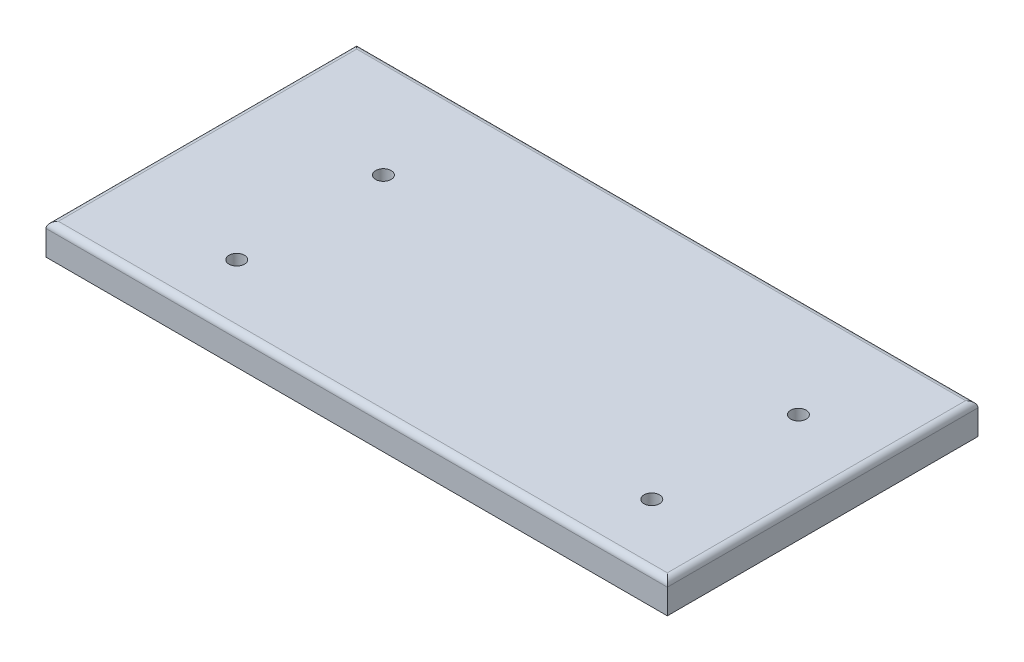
from build123d import *

# Parameters (mm, degrees)
SKETCH1_W                   = 254
SKETCH1_H                   = 127
EXTRUDE1_DEPTH              = 12.7
FILLET1_R                   = 2.54
F_0_25_DIAMETER_HOLE1_D     = 6.35
F_0_25_DIAMETER_HOLE1_DEPTH = 25.4
F_0_25_DIAMETER_HOLE1_TIP   = 1.907732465


with BuildPart() as part:
    # Sketch1 → Extrude1 (new body)
    with BuildSketch(Plane(origin=(0, 0, 0), x_dir=(1, 0, 0), z_dir=(0, 1, 0))):
        with Locations((-127, 63.5)):
            Rectangle(SKETCH1_W, SKETCH1_H)
    extrude(amount=EXTRUDE1_DEPTH)

    # Fillet1
    fillet1_edges = [part.edges().sort_by_distance(p)[0] for p in [
        (-254, 12.7, -63.5),
        (-127, 12.7, 0),
        (0, 12.7, -63.5),
        (-127, 12.7, -127),
    ]]
    fillet(fillet1_edges, radius=FILLET1_R)

    # 0.25_ Diameter Hole1
    with Locations(Plane(origin=(0, 12.7, 0), x_dir=(-1, 0, 0), z_dir=(0, 1, 0))):
        with Locations((201.422, -85.344), (31.75, -85.344), (31.75, -25.4), (201.422, -25.4)):
            Hole(F_0_25_DIAMETER_HOLE1_D / 2, depth=F_0_25_DIAMETER_HOLE1_DEPTH)
            with Locations((0, 0, -(F_0_25_DIAMETER_HOLE1_DEPTH + F_0_25_DIAMETER_HOLE1_TIP / 2))):  # 118° drill point
                Cone(0, F_0_25_DIAMETER_HOLE1_D / 2, F_0_25_DIAMETER_HOLE1_TIP, mode=Mode.SUBTRACT)


solid = part.part
